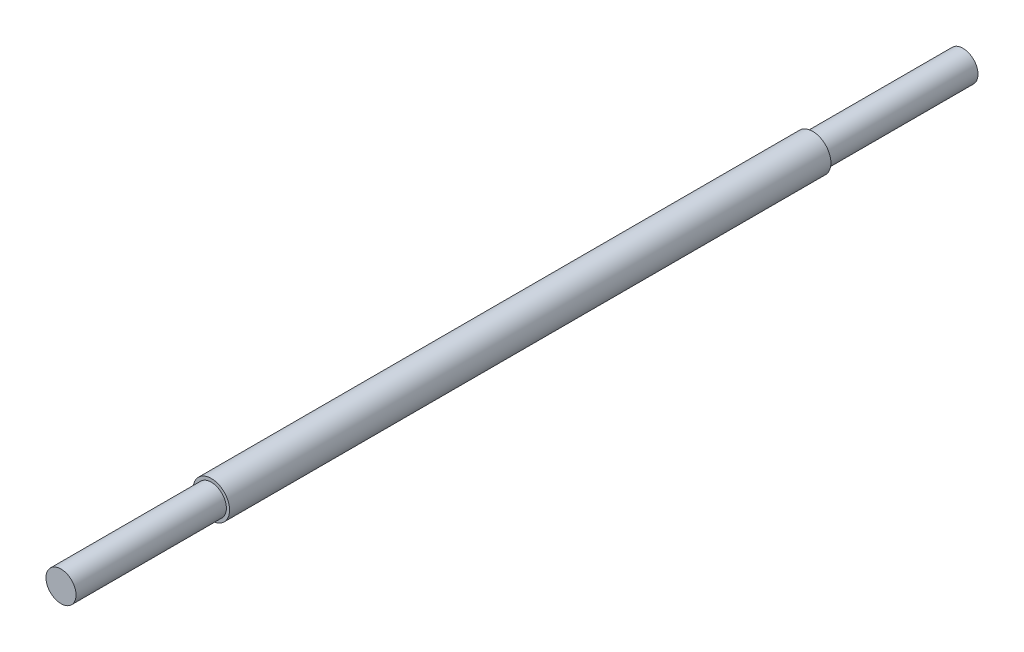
ISO-10303-21;
HEADER;
FILE_DESCRIPTION(('STEP AP214'),'2;1');
FILE_NAME('part.step','',(''),(''),'','','');
FILE_SCHEMA(('AUTOMOTIVE_DESIGN { 1 0 10303 214 1 1 1 1 }'));
ENDSEC;
DATA;
#1=APPLICATION_CONTEXT('core data for automotive mechanical design processes');
#2=APPLICATION_PROTOCOL_DEFINITION('international standard','automotive_design',2000,#1);
#3=PRODUCT_CONTEXT('',#1,'mechanical');
#4=PRODUCT('Part','Part','',(#3));
#5=PRODUCT_RELATED_PRODUCT_CATEGORY('part','',(#4));
#6=PRODUCT_DEFINITION_FORMATION('','',#4);
#7=PRODUCT_DEFINITION_CONTEXT('part definition',#1,'design');
#8=PRODUCT_DEFINITION('design','',#6,#7);
#9=PRODUCT_DEFINITION_SHAPE('','',#8);
#10=(LENGTH_UNIT() NAMED_UNIT(*) SI_UNIT(.MILLI.,.METRE.));
#11=(NAMED_UNIT(*) PLANE_ANGLE_UNIT() SI_UNIT($,.RADIAN.));
#12=(NAMED_UNIT(*) SI_UNIT($,.STERADIAN.) SOLID_ANGLE_UNIT());
#13=UNCERTAINTY_MEASURE_WITH_UNIT(LENGTH_MEASURE(1.E-05),#10,'distance_accuracy_value','');
#14=(GEOMETRIC_REPRESENTATION_CONTEXT(3) GLOBAL_UNCERTAINTY_ASSIGNED_CONTEXT((#13)) GLOBAL_UNIT_ASSIGNED_CONTEXT((#10,
#11,#12)) REPRESENTATION_CONTEXT('',''));
#15=CARTESIAN_POINT('',(0.,0.,0.));
#16=DIRECTION('',(0.,0.,1.));
#17=DIRECTION('',(1.,0.,0.));
#18=AXIS2_PLACEMENT_3D('',#15,#16,#17);
#19=CARTESIAN_POINT('',(0.,0.,700.));
#20=DIRECTION('',(0.,0.,1.));
#21=DIRECTION('',(1.,0.,0.));
#22=AXIS2_PLACEMENT_3D('',#19,#20,#21);
#23=PLANE('',#22);
#24=CARTESIAN_POINT('',(0.,0.,700.));
#25=DIRECTION('',(0.,0.,1.));
#26=DIRECTION('',(1.,0.,0.));
#27=AXIS2_PLACEMENT_3D('',#24,#25,#26);
#28=CIRCLE('',#27,42.5);
#29=CARTESIAN_POINT('',(42.5,0.,700.));
#30=VERTEX_POINT('',#29);
#31=EDGE_CURVE('E37',#30,#30,#28,.T.);
#32=ORIENTED_EDGE('',*,*,#31,.T.);
#33=EDGE_LOOP('',(#32));
#34=FACE_BOUND('',#33,.T.);
#35=CARTESIAN_POINT('',(0.,0.,700.));
#36=DIRECTION('',(0.,0.,1.));
#37=DIRECTION('',(1.,0.,0.));
#38=AXIS2_PLACEMENT_3D('',#35,#36,#37);
#39=CIRCLE('',#38,35.);
#40=CARTESIAN_POINT('',(35.,0.,700.));
#41=VERTEX_POINT('',#40);
#42=EDGE_CURVE('E46',#41,#41,#39,.F.);
#43=ORIENTED_EDGE('',*,*,#42,.T.);
#44=EDGE_LOOP('',(#43));
#45=FACE_BOUND('',#44,.T.);
#46=ADVANCED_FACE('F30',(#34,#45),#23,.T.);
#47=CARTESIAN_POINT('',(0.,0.,-700.));
#48=DIRECTION('',(0.,0.,1.));
#49=DIRECTION('',(1.,0.,0.));
#50=AXIS2_PLACEMENT_3D('',#47,#48,#49);
#51=PLANE('',#50);
#52=CARTESIAN_POINT('',(0.,0.,-700.));
#53=DIRECTION('',(0.,0.,1.));
#54=DIRECTION('',(1.,0.,0.));
#55=AXIS2_PLACEMENT_3D('',#52,#53,#54);
#56=CIRCLE('',#55,42.5);
#57=CARTESIAN_POINT('',(42.5,0.,-700.));
#58=VERTEX_POINT('',#57);
#59=EDGE_CURVE('E41',#58,#58,#56,.T.);
#60=ORIENTED_EDGE('',*,*,#59,.F.);
#61=EDGE_LOOP('',(#60));
#62=FACE_BOUND('',#61,.T.);
#63=CARTESIAN_POINT('',(0.,0.,-700.));
#64=DIRECTION('',(0.,0.,1.));
#65=DIRECTION('',(1.,0.,0.));
#66=AXIS2_PLACEMENT_3D('',#63,#64,#65);
#67=CIRCLE('',#66,35.);
#68=CARTESIAN_POINT('',(35.,0.,-700.));
#69=VERTEX_POINT('',#68);
#70=EDGE_CURVE('E10',#69,#69,#67,.F.);
#71=ORIENTED_EDGE('',*,*,#70,.F.);
#72=EDGE_LOOP('',(#71));
#73=FACE_BOUND('',#72,.T.);
#74=ADVANCED_FACE('F75',(#62,#73),#51,.F.);
#75=CARTESIAN_POINT('',(0.,0.,700.));
#76=DIRECTION('',(0.,0.,-1.));
#77=DIRECTION('',(-1.,0.,0.));
#78=AXIS2_PLACEMENT_3D('',#75,#76,#77);
#79=CYLINDRICAL_SURFACE('',#78,42.5);
#80=ORIENTED_EDGE('',*,*,#31,.F.);
#81=EDGE_LOOP('',(#80));
#82=FACE_BOUND('',#81,.T.);
#83=ORIENTED_EDGE('',*,*,#59,.T.);
#84=EDGE_LOOP('',(#83));
#85=FACE_BOUND('',#84,.T.);
#86=ADVANCED_FACE('F32',(#82,#85),#79,.T.);
#87=CARTESIAN_POINT('',(0.,0.,-1050.));
#88=DIRECTION('',(0.,0.,1.));
#89=DIRECTION('',(1.,0.,0.));
#90=AXIS2_PLACEMENT_3D('',#87,#88,#89);
#91=PLANE('',#90);
#92=CARTESIAN_POINT('',(0.,0.,-1050.));
#93=DIRECTION('',(0.,0.,1.));
#94=DIRECTION('',(1.,0.,0.));
#95=AXIS2_PLACEMENT_3D('',#92,#93,#94);
#96=CIRCLE('',#95,35.);
#97=CARTESIAN_POINT('',(35.,0.,-1050.));
#98=VERTEX_POINT('',#97);
#99=EDGE_CURVE('E51',#98,#98,#96,.T.);
#100=ORIENTED_EDGE('',*,*,#99,.F.);
#101=EDGE_LOOP('',(#100));
#102=FACE_BOUND('',#101,.T.);
#103=ADVANCED_FACE('F69',(#102),#91,.F.);
#104=CARTESIAN_POINT('',(0.,0.,1050.));
#105=DIRECTION('',(0.,0.,-1.));
#106=DIRECTION('',(-1.,0.,0.));
#107=AXIS2_PLACEMENT_3D('',#104,#105,#106);
#108=CYLINDRICAL_SURFACE('',#107,35.);
#109=ORIENTED_EDGE('',*,*,#99,.T.);
#110=EDGE_LOOP('',(#109));
#111=FACE_BOUND('',#110,.T.);
#112=ORIENTED_EDGE('',*,*,#70,.T.);
#113=EDGE_LOOP('',(#112));
#114=FACE_BOUND('',#113,.T.);
#115=ADVANCED_FACE('F61',(#111,#114),#108,.T.);
#116=ORIENTED_EDGE('',*,*,#42,.F.);
#117=EDGE_LOOP('',(#116));
#118=FACE_BOUND('',#117,.T.);
#119=CARTESIAN_POINT('',(0.,0.,1050.));
#120=DIRECTION('',(0.,0.,1.));
#121=DIRECTION('',(1.,0.,0.));
#122=AXIS2_PLACEMENT_3D('',#119,#120,#121);
#123=CIRCLE('',#122,35.);
#124=CARTESIAN_POINT('',(35.,0.,1050.));
#125=VERTEX_POINT('',#124);
#126=EDGE_CURVE('E50',#125,#125,#123,.T.);
#127=ORIENTED_EDGE('',*,*,#126,.F.);
#128=EDGE_LOOP('',(#127));
#129=FACE_BOUND('',#128,.T.);
#130=ADVANCED_FACE('F59',(#118,#129),#108,.T.);
#131=CARTESIAN_POINT('',(0.,0.,1050.));
#132=DIRECTION('',(0.,0.,1.));
#133=DIRECTION('',(1.,0.,0.));
#134=AXIS2_PLACEMENT_3D('',#131,#132,#133);
#135=PLANE('',#134);
#136=ORIENTED_EDGE('',*,*,#126,.T.);
#137=EDGE_LOOP('',(#136));
#138=FACE_BOUND('',#137,.T.);
#139=ADVANCED_FACE('F57',(#138),#135,.T.);
#140=CLOSED_SHELL('',(#46,#74,#86,#103,#115,#130,#139));
#141=MANIFOLD_SOLID_BREP('B2',#140);
#142=ADVANCED_BREP_SHAPE_REPRESENTATION('',(#18,#141),#14);
#143=SHAPE_DEFINITION_REPRESENTATION(#9,#142);
ENDSEC;
END-ISO-10303-21;
